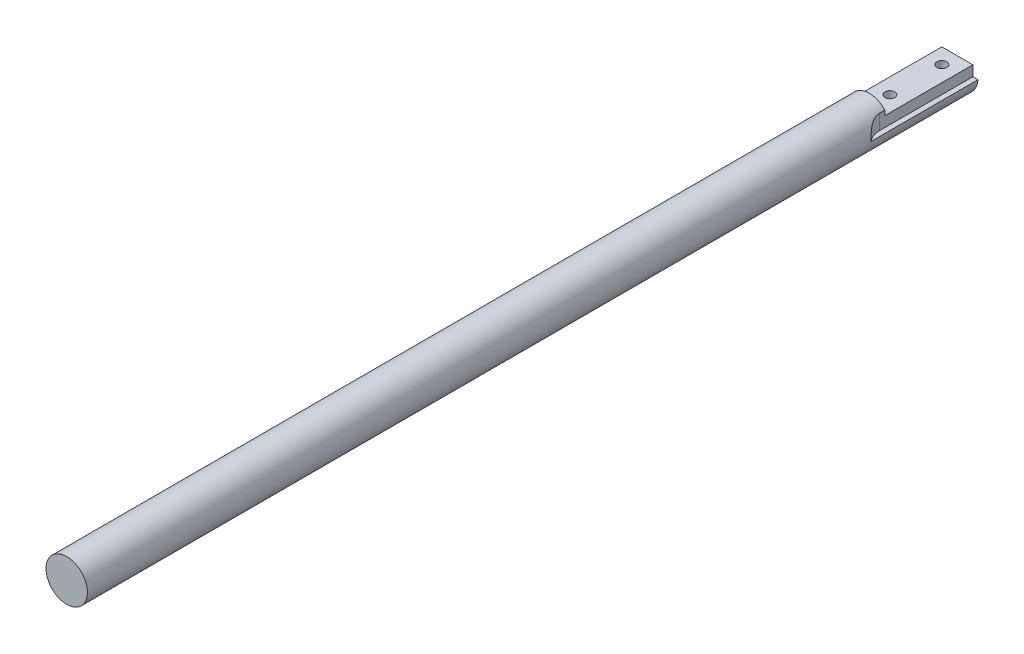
ISO-10303-21;
HEADER;
FILE_DESCRIPTION(('STEP AP214'),'2;1');
FILE_NAME('part.step','',(''),(''),'','','');
FILE_SCHEMA(('AUTOMOTIVE_DESIGN { 1 0 10303 214 1 1 1 1 }'));
ENDSEC;
DATA;
#1=APPLICATION_CONTEXT('core data for automotive mechanical design processes');
#2=APPLICATION_PROTOCOL_DEFINITION('international standard','automotive_design',2000,#1);
#3=PRODUCT_CONTEXT('',#1,'mechanical');
#4=PRODUCT('Part','Part','',(#3));
#5=PRODUCT_RELATED_PRODUCT_CATEGORY('part','',(#4));
#6=PRODUCT_DEFINITION_FORMATION('','',#4);
#7=PRODUCT_DEFINITION_CONTEXT('part definition',#1,'design');
#8=PRODUCT_DEFINITION('design','',#6,#7);
#9=PRODUCT_DEFINITION_SHAPE('','',#8);
#10=(LENGTH_UNIT() NAMED_UNIT(*) SI_UNIT(.MILLI.,.METRE.));
#11=(NAMED_UNIT(*) PLANE_ANGLE_UNIT() SI_UNIT($,.RADIAN.));
#12=(NAMED_UNIT(*) SI_UNIT($,.STERADIAN.) SOLID_ANGLE_UNIT());
#13=UNCERTAINTY_MEASURE_WITH_UNIT(LENGTH_MEASURE(1.E-05),#10,'distance_accuracy_value','');
#14=(GEOMETRIC_REPRESENTATION_CONTEXT(3) GLOBAL_UNCERTAINTY_ASSIGNED_CONTEXT((#13)) GLOBAL_UNIT_ASSIGNED_CONTEXT((#10,
#11,#12)) REPRESENTATION_CONTEXT('',''));
#15=CARTESIAN_POINT('',(0.,0.,0.));
#16=DIRECTION('',(0.,0.,1.));
#17=DIRECTION('',(1.,0.,0.));
#18=AXIS2_PLACEMENT_3D('',#15,#16,#17);
#19=CARTESIAN_POINT('',(0.,0.,136.525));
#20=DIRECTION('',(0.,0.,-1.));
#21=DIRECTION('',(-1.,0.,0.));
#22=AXIS2_PLACEMENT_3D('',#19,#20,#21);
#23=CYLINDRICAL_SURFACE('',#22,3.17500000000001);
#24=CARTESIAN_POINT('',(0.,-3.17500000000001,9.57580866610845));
#25=CARTESIAN_POINT('',(0.0421595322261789,-3.17499925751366,9.57601101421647));
#26=CARTESIAN_POINT('',(0.0843169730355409,-3.17415185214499,9.57972157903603));
#27=CARTESIAN_POINT('',(0.167393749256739,-3.17085734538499,9.59404425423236));
#28=CARTESIAN_POINT('',(0.20831230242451,-3.16840925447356,9.60466063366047));
#29=CARTESIAN_POINT('',(0.287700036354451,-3.16218880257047,9.632438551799));
#30=CARTESIAN_POINT('',(0.326171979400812,-3.15841796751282,9.64959255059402));
#31=CARTESIAN_POINT('',(0.399692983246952,-3.14995900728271,9.68993424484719));
#32=CARTESIAN_POINT('',(0.434741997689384,-3.14527086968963,9.7131220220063));
#33=CARTESIAN_POINT('',(0.501090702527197,-3.13539131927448,9.76534097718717));
#34=CARTESIAN_POINT('',(0.532315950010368,-3.13019266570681,9.79446537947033));
#35=CARTESIAN_POINT('',(0.589487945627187,-3.11993181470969,9.85752729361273));
#36=CARTESIAN_POINT('',(0.615434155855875,-3.11486963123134,9.89146529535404));
#37=CARTESIAN_POINT('',(0.661640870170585,-3.10538595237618,9.96374546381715));
#38=CARTESIAN_POINT('',(0.681821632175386,-3.10097381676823,10.0021399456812));
#39=CARTESIAN_POINT('',(0.715414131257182,-3.09339719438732,10.0818991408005));
#40=CARTESIAN_POINT('',(0.728826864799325,-3.09023252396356,10.1232634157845));
#41=CARTESIAN_POINT('',(0.748256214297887,-3.0855852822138,10.2069706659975));
#42=CARTESIAN_POINT('',(0.754406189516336,-3.08407242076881,10.2492809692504));
#43=CARTESIAN_POINT('',(0.75954839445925,-3.08281022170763,10.3343575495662));
#44=CARTESIAN_POINT('',(0.758541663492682,-3.08306062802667,10.377123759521));
#45=CARTESIAN_POINT('',(0.749508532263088,-3.08526853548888,10.4609159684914));
#46=CARTESIAN_POINT('',(0.741635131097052,-3.08718882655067,10.5019595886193));
#47=CARTESIAN_POINT('',(0.719331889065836,-3.0924612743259,10.5821266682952));
#48=CARTESIAN_POINT('',(0.704901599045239,-3.09581352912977,10.6212499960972));
#49=CARTESIAN_POINT('',(0.669747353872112,-3.10360904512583,10.6969080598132));
#50=CARTESIAN_POINT('',(0.648963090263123,-3.10806267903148,10.7334136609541));
#51=CARTESIAN_POINT('',(0.601734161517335,-3.11755025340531,10.8024762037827));
#52=CARTESIAN_POINT('',(0.575288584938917,-3.12258428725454,10.8350325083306));
#53=CARTESIAN_POINT('',(0.516675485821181,-3.13282256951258,10.8961551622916));
#54=CARTESIAN_POINT('',(0.484377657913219,-3.13802785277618,10.9245965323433));
#55=CARTESIAN_POINT('',(0.415405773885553,-3.14790006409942,10.9756802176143));
#56=CARTESIAN_POINT('',(0.378731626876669,-3.15256698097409,10.9983224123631));
#57=CARTESIAN_POINT('',(0.301906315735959,-3.16084984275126,11.0371897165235));
#58=CARTESIAN_POINT('',(0.261747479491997,-3.1644633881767,11.053400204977));
#59=CARTESIAN_POINT('',(0.179169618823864,-3.17021040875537,11.0788074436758));
#60=CARTESIAN_POINT('',(0.13675099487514,-3.17234414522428,11.0880054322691));
#61=CARTESIAN_POINT('',(0.0519409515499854,-3.17485180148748,11.0989438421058));
#62=CARTESIAN_POINT('',(0.00957292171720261,-3.17526640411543,11.1008565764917));
#63=CARTESIAN_POINT('',(-0.074874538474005,-3.17439781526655,11.0976380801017));
#64=CARTESIAN_POINT('',(-0.11695399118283,-3.17311475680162,11.0925074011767));
#65=CARTESIAN_POINT('',(-0.199073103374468,-3.16901636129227,11.0754880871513));
#66=CARTESIAN_POINT('',(-0.239132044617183,-3.16622095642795,11.0636872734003));
#67=CARTESIAN_POINT('',(-0.316700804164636,-3.1594054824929,11.0337611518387));
#68=CARTESIAN_POINT('',(-0.354210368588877,-3.15538529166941,11.0156352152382));
#69=CARTESIAN_POINT('',(-0.426327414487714,-3.14646056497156,10.9732167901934));
#70=CARTESIAN_POINT('',(-0.460873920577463,-3.14154201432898,10.9488236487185));
#71=CARTESIAN_POINT('',(-0.52544420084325,-3.13139004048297,10.8946964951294));
#72=CARTESIAN_POINT('',(-0.555467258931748,-3.12615656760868,10.8649616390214));
#73=CARTESIAN_POINT('',(-0.6108256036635,-3.1158191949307,10.8002033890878));
#74=CARTESIAN_POINT('',(-0.63604152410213,-3.11072078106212,10.7650769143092));
#75=CARTESIAN_POINT('',(-0.680216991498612,-3.10136127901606,10.690984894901));
#76=CARTESIAN_POINT('',(-0.699176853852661,-3.0971001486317,10.6520195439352));
#77=CARTESIAN_POINT('',(-0.730150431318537,-3.08994466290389,10.571599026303));
#78=CARTESIAN_POINT('',(-0.742209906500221,-3.08704132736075,10.5301623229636));
#79=CARTESIAN_POINT('',(-0.759172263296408,-3.08291423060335,10.4457704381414));
#80=CARTESIAN_POINT('',(-0.764076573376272,-3.08169013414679,10.4028155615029));
#81=CARTESIAN_POINT('',(-0.766526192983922,-3.08108157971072,10.3178335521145));
#82=CARTESIAN_POINT('',(-0.764264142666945,-3.08164896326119,10.2758122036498));
#83=CARTESIAN_POINT('',(-0.752878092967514,-3.0844502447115,10.1927691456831));
#84=CARTESIAN_POINT('',(-0.743754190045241,-3.08668411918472,10.1517474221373));
#85=CARTESIAN_POINT('',(-0.718999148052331,-3.09254339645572,10.072034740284));
#86=CARTESIAN_POINT('',(-0.703397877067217,-3.09616240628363,10.0333340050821));
#87=CARTESIAN_POINT('',(-0.666155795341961,-3.10438779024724,9.95907159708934));
#88=CARTESIAN_POINT('',(-0.644514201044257,-3.10899429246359,9.92351033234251));
#89=CARTESIAN_POINT('',(-0.595180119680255,-3.1188189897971,9.85559473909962));
#90=CARTESIAN_POINT('',(-0.56735205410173,-3.12404943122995,9.82334064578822));
#91=CARTESIAN_POINT('',(-0.50670845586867,-3.13445630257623,9.7638980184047));
#92=CARTESIAN_POINT('',(-0.473891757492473,-3.13963271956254,9.73671067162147));
#93=CARTESIAN_POINT('',(-0.403561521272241,-3.14945115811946,9.68774801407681));
#94=CARTESIAN_POINT('',(-0.365980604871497,-3.15408318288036,9.66606734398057));
#95=CARTESIAN_POINT('',(-0.287600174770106,-3.16219199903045,9.62936737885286));
#96=CARTESIAN_POINT('',(-0.246803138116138,-3.16566966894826,9.61434301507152));
#97=CARTESIAN_POINT('',(-0.171689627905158,-3.17053067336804,9.59376001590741));
#98=CARTESIAN_POINT('',(-0.137742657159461,-3.1721961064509,9.58689769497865));
#99=CARTESIAN_POINT('',(-0.0691966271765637,-3.17443103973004,9.57783914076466));
#100=CARTESIAN_POINT('',(-0.0345976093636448,-3.17500060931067,9.57564261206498));
#101=CARTESIAN_POINT('',(0.,-3.17500000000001,9.57580866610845));
#102=B_SPLINE_CURVE_WITH_KNOTS('',3,(#24,#25,#26,#27,#28,#29,#30,#31,#32,#33,#34,#35,#36,#37,
#38,#39,#40,#41,#42,#43,#44,#45,#46,#47,#48,#49,#50,#51,#52,#53,#54,#55,#56,#57,#58,#59,#60,#61,
#62,#63,#64,#65,#66,#67,#68,#69,#70,#71,#72,#73,#74,#75,#76,#77,#78,#79,#80,#81,#82,#83,#84,#85,
#86,#87,#88,#89,#90,#91,#92,#93,#94,#95,#96,#97,#98,#99,#100,#101),.UNSPECIFIED.,.T.,.F.,(4,2,2,
2,2,2,2,2,2,2,2,2,2,2,2,2,2,2,2,2,2,2,2,2,2,2,2,2,2,2,2,2,2,2,2,2,2,2,4),(0.,0.126353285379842,
0.252784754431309,0.379070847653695,0.505358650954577,0.633808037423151,0.762270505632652,
0.892432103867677,1.02257453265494,1.15028816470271,1.2779832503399,1.40290376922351,
1.52783284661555,1.65398657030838,1.78016061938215,1.90959813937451,2.03903834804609,
2.16877114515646,2.29848102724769,2.42510320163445,2.55171545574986,2.67669827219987,
2.80169351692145,2.92883756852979,3.0560017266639,3.18599950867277,3.3159907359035,
3.44510962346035,3.57420273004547,3.69985539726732,3.8255062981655,3.95058412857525,
4.07567819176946,4.2038451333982,4.33204207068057,4.4623123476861,4.5924832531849,
4.69617981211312,4.79986980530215),.UNSPECIFIED.);
#103=CARTESIAN_POINT('',(0.,-3.17500000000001,9.57580866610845));
#104=VERTEX_POINT('',#103);
#105=EDGE_CURVE('E11',#104,#104,#102,.T.);
#106=ORIENTED_EDGE('',*,*,#105,.F.);
#107=EDGE_LOOP('',(#106));
#108=FACE_BOUND('',#107,.T.);
#109=CARTESIAN_POINT('',(0.,-3.17500000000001,1.60036599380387));
#110=CARTESIAN_POINT('',(0.0421684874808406,-3.17499926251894,1.60124759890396));
#111=CARTESIAN_POINT('',(0.084278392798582,-3.17415150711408,1.60563987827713));
#112=CARTESIAN_POINT('',(0.167148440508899,-3.1708689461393,1.62131106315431));
#113=CARTESIAN_POINT('',(0.207907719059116,-3.16843314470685,1.63259428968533));
#114=CARTESIAN_POINT('',(0.286870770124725,-3.16226146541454,1.6616721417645));
#115=CARTESIAN_POINT('',(0.325077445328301,-3.158527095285,1.6794592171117));
#116=CARTESIAN_POINT('',(0.397969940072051,-3.15017344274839,1.72101917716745));
#117=CARTESIAN_POINT('',(0.432655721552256,-3.14555415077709,1.74479212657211));
#118=CARTESIAN_POINT('',(0.498179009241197,-3.13585071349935,1.79812816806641));
#119=CARTESIAN_POINT('',(0.52894081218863,-3.13075998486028,1.82778307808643));
#120=CARTESIAN_POINT('',(0.585101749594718,-3.12075256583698,1.89182784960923));
#121=CARTESIAN_POINT('',(0.610500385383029,-3.11583589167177,1.92621815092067));
#122=CARTESIAN_POINT('',(0.655504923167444,-3.10668214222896,1.99927304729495));
#123=CARTESIAN_POINT('',(0.675037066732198,-3.10245400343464,2.03798429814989));
#124=CARTESIAN_POINT('',(0.707287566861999,-3.0952615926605,2.11825801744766));
#125=CARTESIAN_POINT('',(0.720006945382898,-3.0922971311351,2.15982005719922));
#126=CARTESIAN_POINT('',(0.738037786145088,-3.08804311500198,2.24377831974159));
#127=CARTESIAN_POINT('',(0.74348519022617,-3.08672285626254,2.28614376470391));
#128=CARTESIAN_POINT('',(0.747230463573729,-3.08581850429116,2.37120513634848));
#129=CARTESIAN_POINT('',(0.745529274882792,-3.08623418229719,2.41390101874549));
#130=CARTESIAN_POINT('',(0.735145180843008,-3.08872356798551,2.4975061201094));
#131=CARTESIAN_POINT('',(0.726603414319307,-3.09076375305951,2.53843400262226));
#132=CARTESIAN_POINT('',(0.702989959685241,-3.09621958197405,2.6182624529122));
#133=CARTESIAN_POINT('',(0.687917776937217,-3.09963533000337,2.65716286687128));
#134=CARTESIAN_POINT('',(0.651490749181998,-3.10749643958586,2.7323234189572));
#135=CARTESIAN_POINT('',(0.630068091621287,-3.11195279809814,2.76854949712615));
#136=CARTESIAN_POINT('',(0.581601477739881,-3.12137350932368,2.83695095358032));
#137=CARTESIAN_POINT('',(0.554556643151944,-3.12633794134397,2.86912569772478));
#138=CARTESIAN_POINT('',(0.494819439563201,-3.13635399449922,2.9293398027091));
#139=CARTESIAN_POINT('',(0.462004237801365,-3.14140474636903,2.95725760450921));
#140=CARTESIAN_POINT('',(0.392083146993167,-3.15089489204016,3.00720863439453));
#141=CARTESIAN_POINT('',(0.354977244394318,-3.15533428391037,3.02924184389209));
#142=CARTESIAN_POINT('',(0.277483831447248,-3.1630905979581,3.06677099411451));
#143=CARTESIAN_POINT('',(0.237096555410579,-3.1664076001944,3.08226740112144));
#144=CARTESIAN_POINT('',(0.154195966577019,-3.17152504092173,3.10622324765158));
#145=CARTESIAN_POINT('',(0.111683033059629,-3.17332574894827,3.11468393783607));
#146=CARTESIAN_POINT('',(0.0268357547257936,-3.17516333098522,3.12416832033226));
#147=CARTESIAN_POINT('',(-0.0154783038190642,-3.17524157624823,3.12536594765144));
#148=CARTESIAN_POINT('',(-0.0996892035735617,-3.17371396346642,3.1207525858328));
#149=CARTESIAN_POINT('',(-0.141586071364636,-3.17210821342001,3.11494204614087));
#150=CARTESIAN_POINT('',(-0.223320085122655,-3.1673983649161,3.09661033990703));
#151=CARTESIAN_POINT('',(-0.263174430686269,-3.16431042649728,3.08416139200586));
#152=CARTESIAN_POINT('',(-0.340229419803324,-3.15695556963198,3.05298589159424));
#153=CARTESIAN_POINT('',(-0.377429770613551,-3.15268852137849,3.03425864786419));
#154=CARTESIAN_POINT('',(-0.448897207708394,-3.14331689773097,2.99064786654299));
#155=CARTESIAN_POINT('',(-0.483095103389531,-3.13819794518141,2.96565408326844));
#156=CARTESIAN_POINT('',(-0.546871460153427,-3.12771530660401,2.9103781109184));
#157=CARTESIAN_POINT('',(-0.576449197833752,-3.12235158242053,2.88009509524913));
#158=CARTESIAN_POINT('',(-0.630794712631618,-3.11183341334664,2.81431968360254));
#159=CARTESIAN_POINT('',(-0.655445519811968,-3.10668593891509,2.77872935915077));
#160=CARTESIAN_POINT('',(-0.698413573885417,-3.09730999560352,2.70379894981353));
#161=CARTESIAN_POINT('',(-0.716731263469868,-3.09308146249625,2.66445912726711));
#162=CARTESIAN_POINT('',(-0.746322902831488,-3.0860748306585,2.58349825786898));
#163=CARTESIAN_POINT('',(-0.757659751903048,-3.08328381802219,2.54190137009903));
#164=CARTESIAN_POINT('',(-0.773165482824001,-3.07943263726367,2.4573170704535));
#165=CARTESIAN_POINT('',(-0.777335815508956,-3.07837211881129,2.41432994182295));
#166=CARTESIAN_POINT('',(-0.778350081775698,-3.07811563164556,2.32944505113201));
#167=CARTESIAN_POINT('',(-0.775391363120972,-3.07886943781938,2.28754966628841));
#168=CARTESIAN_POINT('',(-0.762658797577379,-3.08204784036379,2.20487531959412));
#169=CARTESIAN_POINT('',(-0.752884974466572,-3.08447243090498,2.16409635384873));
#170=CARTESIAN_POINT('',(-0.72687680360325,-3.09070409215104,2.08490102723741));
#171=CARTESIAN_POINT('',(-0.710660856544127,-3.09450722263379,2.04647829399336));
#172=CARTESIAN_POINT('',(-0.672248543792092,-3.10307791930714,1.9728666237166));
#173=CARTESIAN_POINT('',(-0.650051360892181,-3.1078456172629,1.93767812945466));
#174=CARTESIAN_POINT('',(-0.599628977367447,-3.11797154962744,1.87055288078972));
#175=CARTESIAN_POINT('',(-0.571262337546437,-3.12334189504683,1.83872416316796));
#176=CARTESIAN_POINT('',(-0.509611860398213,-3.1339906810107,1.78021783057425));
#177=CARTESIAN_POINT('',(-0.47632688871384,-3.13926910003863,1.75354140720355));
#178=CARTESIAN_POINT('',(-0.405156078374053,-3.14925123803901,1.70569854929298));
#179=CARTESIAN_POINT('',(-0.367206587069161,-3.15394471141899,1.68462452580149));
#180=CARTESIAN_POINT('',(-0.2881914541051,-3.16214216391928,1.64919565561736));
#181=CARTESIAN_POINT('',(-0.247128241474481,-3.16564705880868,1.6348356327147));
#182=CARTESIAN_POINT('',(-0.17170892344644,-3.17053067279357,1.61550088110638));
#183=CARTESIAN_POINT('',(-0.137703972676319,-3.17219799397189,1.60920549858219));
#184=CARTESIAN_POINT('',(-0.0691195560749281,-3.17443292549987,1.60127713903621));
#185=CARTESIAN_POINT('',(-0.0345401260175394,-3.17500060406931,1.59964387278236));
#186=CARTESIAN_POINT('',(0.,-3.17500000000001,1.60036599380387));
#187=B_SPLINE_CURVE_WITH_KNOTS('',3,(#109,#110,#111,#112,#113,#114,#115,#116,#117,#118,#119,
#120,#121,#122,#123,#124,#125,#126,#127,#128,#129,#130,#131,#132,#133,#134,#135,#136,#137,#138,
#139,#140,#141,#142,#143,#144,#145,#146,#147,#148,#149,#150,#151,#152,#153,#154,#155,#156,#157,
#158,#159,#160,#161,#162,#163,#164,#165,#166,#167,#168,#169,#170,#171,#172,#173,#174,#175,#176,
#177,#178,#179,#180,#181,#182,#183,#184,#185,#186),.UNSPECIFIED.,.T.,.F.,(4,2,2,2,2,2,2,2,2,2,2,
2,2,2,2,2,2,2,2,2,2,2,2,2,2,2,2,2,2,2,2,2,2,2,2,2,2,2,4),(0.,0.126406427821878,
0.252892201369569,0.379231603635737,0.505572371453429,0.634067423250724,0.762574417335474,
0.892635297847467,1.022676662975,1.15025131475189,1.27780915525,1.40280092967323,
1.52780217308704,1.65418950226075,1.78059658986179,1.91012119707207,2.0396462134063,
2.1691619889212,2.29865473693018,2.42503375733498,2.55140467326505,2.67642804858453,
2.80146519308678,2.92887888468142,3.05631250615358,3.18648350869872,3.31664541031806,
3.44561666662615,3.57456181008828,3.6999786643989,3.82539508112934,3.9504558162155,
4.07553364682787,4.20385621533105,4.33220842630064,4.46256218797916,4.59281528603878,
4.69636096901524,4.79990022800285),.UNSPECIFIED.);
#188=CARTESIAN_POINT('',(0.,-3.17500000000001,1.60036599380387));
#189=VERTEX_POINT('',#188);
#190=EDGE_CURVE('E46',#189,#189,#187,.T.);
#191=ORIENTED_EDGE('',*,*,#190,.F.);
#192=EDGE_LOOP('',(#191));
#193=FACE_BOUND('',#192,.T.);
#194=CARTESIAN_POINT('',(0.,0.,136.525));
#195=DIRECTION('',(0.,0.,-1.));
#196=DIRECTION('',(-1.,0.,0.));
#197=AXIS2_PLACEMENT_3D('',#194,#195,#196);
#198=CIRCLE('',#197,3.17500000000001);
#199=CARTESIAN_POINT('',(-3.17500000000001,0.,136.525));
#200=VERTEX_POINT('',#199);
#201=EDGE_CURVE('E161',#200,#200,#198,.T.);
#202=ORIENTED_EDGE('',*,*,#201,.T.);
#203=EDGE_LOOP('',(#202));
#204=FACE_BOUND('',#203,.T.);
#205=CARTESIAN_POINT('',(0.,0.,13.49375));
#206=DIRECTION('',(0.,0.,-1.));
#207=DIRECTION('',(-1.,0.,0.));
#208=AXIS2_PLACEMENT_3D('',#205,#206,#207);
#209=CIRCLE('',#208,3.17500000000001);
#210=CARTESIAN_POINT('',(2.38125,2.10006510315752,13.49375));
#211=VERTEX_POINT('',#210);
#212=CARTESIAN_POINT('',(-2.38125,2.10006510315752,13.49375));
#213=VERTEX_POINT('',#212);
#214=EDGE_CURVE('E166',#211,#213,#209,.F.);
#215=ORIENTED_EDGE('',*,*,#214,.T.);
#216=DIRECTION('',(0.,0.,-1.));
#217=VECTOR('',#216,1.);
#218=CARTESIAN_POINT('',(-2.38125,2.10006510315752,136.525));
#219=LINE('',#218,#217);
#220=CARTESIAN_POINT('',(-2.38125,2.10006510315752,14.2875));
#221=VERTEX_POINT('',#220);
#222=EDGE_CURVE('E127',#213,#221,#219,.F.);
#223=ORIENTED_EDGE('',*,*,#222,.T.);
#224=CARTESIAN_POINT('',(-3.17500000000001,0.,16.3875651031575));
#225=CARTESIAN_POINT('',(-3.17499373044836,-0.114105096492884,16.3875662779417));
#226=CARTESIAN_POINT('',(-3.16880431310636,-0.228314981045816,16.3806040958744));
#227=CARTESIAN_POINT('',(-3.14445190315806,-0.453811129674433,16.3524915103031));
#228=CARTESIAN_POINT('',(-3.12627048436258,-0.565092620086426,16.3313192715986));
#229=CARTESIAN_POINT('',(-3.07928517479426,-0.781599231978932,16.2741146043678));
#230=CARTESIAN_POINT('',(-3.05046985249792,-0.886817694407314,16.2380661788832));
#231=CARTESIAN_POINT('',(-2.98470907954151,-1.08780005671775,16.1505031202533));
#232=CARTESIAN_POINT('',(-2.94776944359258,-1.18357064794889,16.0989995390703));
#233=CARTESIAN_POINT('',(-2.87006273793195,-1.36109667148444,15.9815668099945));
#234=CARTESIAN_POINT('',(-2.82938319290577,-1.44308671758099,15.9159349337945));
#235=CARTESIAN_POINT('',(-2.74766913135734,-1.59319182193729,15.7705468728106));
#236=CARTESIAN_POINT('',(-2.7066346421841,-1.66130793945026,15.6907917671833));
#237=CARTESIAN_POINT('',(-2.62962545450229,-1.78061484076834,15.5219274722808));
#238=CARTESIAN_POINT('',(-2.59352800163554,-1.83229246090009,15.4332167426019));
#239=CARTESIAN_POINT('',(-2.52801303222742,-1.9216810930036,15.2467560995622));
#240=CARTESIAN_POINT('',(-2.49859687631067,-1.95938926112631,15.1490043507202));
#241=CARTESIAN_POINT('',(-2.44817130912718,-2.02206600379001,14.9446324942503));
#242=CARTESIAN_POINT('',(-2.42738954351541,-2.04669386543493,14.8378521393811));
#243=CARTESIAN_POINT('',(-2.3968532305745,-2.08237160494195,14.6205056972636));
#244=CARTESIAN_POINT('',(-2.38710192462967,-2.09341749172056,14.5099385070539));
#245=CARTESIAN_POINT('',(-2.37912529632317,-2.10248275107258,14.2826577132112));
#246=CARTESIAN_POINT('',(-2.3814602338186,-2.09986887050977,14.1658984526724));
#247=CARTESIAN_POINT('',(-2.39879593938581,-2.08004152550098,13.9345616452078));
#248=CARTESIAN_POINT('',(-2.41379819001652,-2.0628263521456,13.8199843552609));
#249=CARTESIAN_POINT('',(-2.4555228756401,-2.01298183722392,13.595180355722));
#250=CARTESIAN_POINT('',(-2.48236070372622,-1.98020048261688,13.4850084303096));
#251=CARTESIAN_POINT('',(-2.54542460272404,-1.89844295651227,13.2737462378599));
#252=CARTESIAN_POINT('',(-2.58164651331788,-1.84947395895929,13.1726519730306));
#253=CARTESIAN_POINT('',(-2.6583726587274,-1.73726664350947,12.9864665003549));
#254=CARTESIAN_POINT('',(-2.69865613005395,-1.67465589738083,12.9009064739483));
#255=CARTESIAN_POINT('',(-2.78055309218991,-1.53482479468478,12.7434732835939));
#256=CARTESIAN_POINT('',(-2.82216623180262,-1.4576082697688,12.6715965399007));
#257=CARTESIAN_POINT('',(-2.90092371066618,-1.29352877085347,12.5453138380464));
#258=CARTESIAN_POINT('',(-2.93817863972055,-1.20715439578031,12.4903396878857));
#259=CARTESIAN_POINT('',(-3.0066570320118,-1.02475707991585,12.394437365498));
#260=CARTESIAN_POINT('',(-3.03787928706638,-0.928732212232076,12.3535120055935));
#261=CARTESIAN_POINT('',(-3.09222873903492,-0.727854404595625,12.2847036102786));
#262=CARTESIAN_POINT('',(-3.11519555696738,-0.622871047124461,12.2570757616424));
#263=CARTESIAN_POINT('',(-3.15048522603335,-0.408508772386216,12.2153831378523));
#264=CARTESIAN_POINT('',(-3.16280500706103,-0.299128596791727,12.2013222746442));
#265=CARTESIAN_POINT('',(-3.17625369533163,-0.0735132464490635,12.1859863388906));
#266=CARTESIAN_POINT('',(-3.17681986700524,0.0427997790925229,12.1853541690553));
#267=CARTESIAN_POINT('',(-3.16527304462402,0.273992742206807,12.1984984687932));
#268=CARTESIAN_POINT('',(-3.15315796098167,0.388872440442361,12.2122773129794));
#269=CARTESIAN_POINT('',(-3.11686760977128,0.615757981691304,12.2550540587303));
#270=CARTESIAN_POINT('',(-3.09250434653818,0.727689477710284,12.2842895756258));
#271=CARTESIAN_POINT('',(-3.03371189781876,0.943230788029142,12.3588566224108));
#272=CARTESIAN_POINT('',(-2.99928667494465,1.04684385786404,12.4041818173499));
#273=CARTESIAN_POINT('',(-2.92500990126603,1.23903067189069,12.5095271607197));
#274=CARTESIAN_POINT('',(-2.88538722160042,1.32800064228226,12.568984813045));
#275=CARTESIAN_POINT('',(-2.80381970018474,1.49253558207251,12.7029269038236));
#276=CARTESIAN_POINT('',(-2.76187562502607,1.56810494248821,12.777406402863));
#277=CARTESIAN_POINT('',(-2.68174153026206,1.70138147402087,12.9364254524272));
#278=CARTESIAN_POINT('',(-2.64346772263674,1.7597114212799,13.0204027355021));
#279=CARTESIAN_POINT('',(-2.57226612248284,1.86225219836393,13.1986157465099));
#280=CARTESIAN_POINT('',(-2.53933925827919,1.90646057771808,13.2928532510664));
#281=CARTESIAN_POINT('',(-2.48127453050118,1.98146146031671,13.490102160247));
#282=CARTESIAN_POINT('',(-2.45623176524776,2.01209185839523,13.5932029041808));
#283=CARTESIAN_POINT('',(-2.41637708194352,2.05978523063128,13.8044023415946));
#284=CARTESIAN_POINT('',(-2.40156806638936,2.0768443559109,13.9125024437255));
#285=CARTESIAN_POINT('',(-2.38278169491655,2.09838001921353,14.1361501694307));
#286=CARTESIAN_POINT('',(-2.37935718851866,2.10221466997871,14.2518064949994));
#287=CARTESIAN_POINT('',(-2.38513933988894,2.09565060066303,14.482416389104));
#288=CARTESIAN_POINT('',(-2.39434855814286,2.08524899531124,14.5973698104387));
#289=CARTESIAN_POINT('',(-2.42505594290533,2.04946266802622,14.8258368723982));
#290=CARTESIAN_POINT('',(-2.44681346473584,2.02376135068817,14.9392667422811));
#291=CARTESIAN_POINT('',(-2.50099572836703,1.95639997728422,15.1585882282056));
#292=CARTESIAN_POINT('',(-2.53341704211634,1.91474504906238,15.2644822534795));
#293=CARTESIAN_POINT('',(-2.60479004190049,1.81638515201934,15.46233877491));
#294=CARTESIAN_POINT('',(-2.64351868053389,1.76016494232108,15.5546220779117));
#295=CARTESIAN_POINT('',(-2.72429416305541,1.63233933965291,15.7261254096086));
#296=CARTESIAN_POINT('',(-2.76633946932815,1.5607410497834,15.8053514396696));
#297=CARTESIAN_POINT('',(-2.84747574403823,1.40701841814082,15.9456487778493));
#298=CARTESIAN_POINT('',(-2.88661408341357,1.32552137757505,16.0073821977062));
#299=CARTESIAN_POINT('',(-2.96028509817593,1.15162818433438,16.1166948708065));
#300=CARTESIAN_POINT('',(-2.99481550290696,1.05922670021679,16.1642671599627));
#301=CARTESIAN_POINT('',(-3.0564100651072,0.865654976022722,16.245573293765));
#302=CARTESIAN_POINT('',(-3.08343555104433,0.764442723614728,16.2792358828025));
#303=CARTESIAN_POINT('',(-3.12764732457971,0.556522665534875,16.3329178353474));
#304=CARTESIAN_POINT('',(-3.14484569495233,0.44982178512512,16.3529539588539));
#305=CARTESIAN_POINT('',(-3.16266595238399,0.285331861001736,16.3735138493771));
#306=CARTESIAN_POINT('',(-3.16728172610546,0.228499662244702,16.3787862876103));
#307=CARTESIAN_POINT('',(-3.17345032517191,0.114453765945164,16.3858116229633));
#308=CARTESIAN_POINT('',(-3.17500314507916,0.0572400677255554,16.3875645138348));
#309=CARTESIAN_POINT('',(-3.17500000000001,0.,16.3875651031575));
#310=B_SPLINE_CURVE_WITH_KNOTS('',3,(#224,#225,#226,#227,#228,#229,#230,#231,#232,#233,#234,
#235,#236,#237,#238,#239,#240,#241,#242,#243,#244,#245,#246,#247,#248,#249,#250,#251,#252,#253,
#254,#255,#256,#257,#258,#259,#260,#261,#262,#263,#264,#265,#266,#267,#268,#269,#270,#271,#272,
#273,#274,#275,#276,#277,#278,#279,#280,#281,#282,#283,#284,#285,#286,#287,#288,#289,#290,#291,
#292,#293,#294,#295,#296,#297,#298,#299,#300,#301,#302,#303,#304,#305,#306,#307,#308,#309),
.UNSPECIFIED.,.T.,.F.,(4,2,2,2,2,2,2,2,2,2,2,2,2,2,2,2,2,2,2,2,2,2,2,2,2,2,2,2,2,2,2,2,2,2,2,2,
2,2,2,2,2,2,4),(0.,0.342115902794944,0.684758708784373,1.02777093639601,1.37053845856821,
1.70669738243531,2.04283063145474,2.36780437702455,2.69284424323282,3.02598021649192,
3.35921405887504,3.70802947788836,4.05688572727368,4.40922111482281,4.76140056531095,
5.09991151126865,5.43833377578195,5.76366700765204,6.08906532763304,6.42048121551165,
6.75199263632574,7.09934127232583,7.44674715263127,7.79965600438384,8.15242606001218,
8.49299444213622,8.83345102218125,9.15943432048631,9.48547415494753,9.81530806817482,
10.1452354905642,10.4909673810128,10.8367693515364,11.1899886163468,11.5430944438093,
11.8856922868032,12.2281322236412,12.5549883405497,12.8820049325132,13.2106765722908,
13.5389432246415,13.710563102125,13.8821832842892),.UNSPECIFIED.);
#311=CARTESIAN_POINT('',(-3.16879276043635,-0.198437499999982,16.3805057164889));
#312=VERTEX_POINT('',#311);
#313=EDGE_CURVE('E123',#221,#312,#310,.T.);
#314=ORIENTED_EDGE('',*,*,#313,.T.);
#315=DIRECTION('',(0.,0.,-1.));
#316=VECTOR('',#315,1.);
#317=CARTESIAN_POINT('',(-3.16879276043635,-0.198437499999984,136.525));
#318=LINE('',#317,#316);
#319=CARTESIAN_POINT('',(-3.16879276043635,-0.198437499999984,0.));
#320=VERTEX_POINT('',#319);
#321=EDGE_CURVE('E117',#320,#312,#318,.F.);
#322=ORIENTED_EDGE('',*,*,#321,.F.);
#323=CARTESIAN_POINT('',(0.,0.,0.));
#324=DIRECTION('',(0.,0.,-1.));
#325=DIRECTION('',(-1.,0.,0.));
#326=AXIS2_PLACEMENT_3D('',#323,#324,#325);
#327=CIRCLE('',#326,3.17500000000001);
#328=CARTESIAN_POINT('',(3.16879276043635,-0.198437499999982,0.));
#329=VERTEX_POINT('',#328);
#330=EDGE_CURVE('E158',#329,#320,#327,.T.);
#331=ORIENTED_EDGE('',*,*,#330,.F.);
#332=DIRECTION('',(0.,0.,-1.));
#333=VECTOR('',#332,1.);
#334=CARTESIAN_POINT('',(3.16879276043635,-0.198437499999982,136.525));
#335=LINE('',#334,#333);
#336=CARTESIAN_POINT('',(3.16879276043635,-0.198437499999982,16.3805057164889));
#337=VERTEX_POINT('',#336);
#338=EDGE_CURVE('E61',#337,#329,#335,.T.);
#339=ORIENTED_EDGE('',*,*,#338,.F.);
#340=CARTESIAN_POINT('',(3.17500000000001,0.,16.3875651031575));
#341=CARTESIAN_POINT('',(3.17499373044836,0.114105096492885,16.3875662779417));
#342=CARTESIAN_POINT('',(3.16880431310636,0.228314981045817,16.3806040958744));
#343=CARTESIAN_POINT('',(3.14445190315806,0.453811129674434,16.3524915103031));
#344=CARTESIAN_POINT('',(3.12627048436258,0.565092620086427,16.3313192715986));
#345=CARTESIAN_POINT('',(3.07928517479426,0.781599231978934,16.2741146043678));
#346=CARTESIAN_POINT('',(3.05046985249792,0.886817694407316,16.2380661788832));
#347=CARTESIAN_POINT('',(2.98470907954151,1.08780005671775,16.1505031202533));
#348=CARTESIAN_POINT('',(2.94776944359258,1.18357064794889,16.0989995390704));
#349=CARTESIAN_POINT('',(2.87006273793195,1.36109667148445,15.9815668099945));
#350=CARTESIAN_POINT('',(2.82938319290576,1.44308671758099,15.9159349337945));
#351=CARTESIAN_POINT('',(2.74766913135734,1.59319182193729,15.7705468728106));
#352=CARTESIAN_POINT('',(2.7066346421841,1.66130793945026,15.6907917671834));
#353=CARTESIAN_POINT('',(2.62962545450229,1.78061484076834,15.5219274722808));
#354=CARTESIAN_POINT('',(2.59352800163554,1.83229246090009,15.433216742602));
#355=CARTESIAN_POINT('',(2.52801303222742,1.92168109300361,15.2467560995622));
#356=CARTESIAN_POINT('',(2.49859687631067,1.95938926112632,15.1490043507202));
#357=CARTESIAN_POINT('',(2.44817130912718,2.02206600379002,14.9446324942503));
#358=CARTESIAN_POINT('',(2.42738954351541,2.04669386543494,14.8378521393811));
#359=CARTESIAN_POINT('',(2.3968532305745,2.08237160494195,14.6205056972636));
#360=CARTESIAN_POINT('',(2.38710192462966,2.09341749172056,14.5099385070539));
#361=CARTESIAN_POINT('',(2.37912529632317,2.10248275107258,14.2826577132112));
#362=CARTESIAN_POINT('',(2.38146023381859,2.09986887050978,14.1658984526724));
#363=CARTESIAN_POINT('',(2.3987959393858,2.08004152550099,13.9345616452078));
#364=CARTESIAN_POINT('',(2.41379819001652,2.06282635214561,13.819984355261));
#365=CARTESIAN_POINT('',(2.4555228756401,2.01298183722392,13.595180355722));
#366=CARTESIAN_POINT('',(2.48236070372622,1.98020048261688,13.4850084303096));
#367=CARTESIAN_POINT('',(2.54542460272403,1.89844295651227,13.2737462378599));
#368=CARTESIAN_POINT('',(2.58164651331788,1.8494739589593,13.1726519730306));
#369=CARTESIAN_POINT('',(2.65837265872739,1.73726664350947,12.9864665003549));
#370=CARTESIAN_POINT('',(2.69865613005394,1.67465589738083,12.9009064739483));
#371=CARTESIAN_POINT('',(2.78055309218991,1.53482479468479,12.7434732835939));
#372=CARTESIAN_POINT('',(2.82216623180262,1.45760826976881,12.6715965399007));
#373=CARTESIAN_POINT('',(2.90092371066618,1.29352877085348,12.5453138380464));
#374=CARTESIAN_POINT('',(2.93817863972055,1.20715439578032,12.4903396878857));
#375=CARTESIAN_POINT('',(3.0066570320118,1.02475707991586,12.394437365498));
#376=CARTESIAN_POINT('',(3.03787928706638,0.928732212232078,12.3535120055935));
#377=CARTESIAN_POINT('',(3.09222873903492,0.727854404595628,12.2847036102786));
#378=CARTESIAN_POINT('',(3.11519555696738,0.622871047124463,12.2570757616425));
#379=CARTESIAN_POINT('',(3.15048522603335,0.408508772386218,12.2153831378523));
#380=CARTESIAN_POINT('',(3.16280500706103,0.29912859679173,12.2013222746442));
#381=CARTESIAN_POINT('',(3.17625369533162,0.0735132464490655,12.1859863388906));
#382=CARTESIAN_POINT('',(3.17681986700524,-0.0427997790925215,12.1853541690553));
#383=CARTESIAN_POINT('',(3.16527304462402,-0.273992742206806,12.1984984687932));
#384=CARTESIAN_POINT('',(3.15315796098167,-0.38887244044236,12.2122773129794));
#385=CARTESIAN_POINT('',(3.11686760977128,-0.615757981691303,12.2550540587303));
#386=CARTESIAN_POINT('',(3.09250434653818,-0.727689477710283,12.2842895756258));
#387=CARTESIAN_POINT('',(3.03371189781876,-0.943230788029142,12.3588566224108));
#388=CARTESIAN_POINT('',(2.99928667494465,-1.04684385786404,12.4041818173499));
#389=CARTESIAN_POINT('',(2.92500990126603,-1.23903067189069,12.5095271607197));
#390=CARTESIAN_POINT('',(2.88538722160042,-1.32800064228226,12.568984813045));
#391=CARTESIAN_POINT('',(2.80381970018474,-1.49253558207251,12.7029269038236));
#392=CARTESIAN_POINT('',(2.76187562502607,-1.56810494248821,12.777406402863));
#393=CARTESIAN_POINT('',(2.68174153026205,-1.70138147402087,12.9364254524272));
#394=CARTESIAN_POINT('',(2.64346772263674,-1.75971142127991,13.0204027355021));
#395=CARTESIAN_POINT('',(2.57226612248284,-1.86225219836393,13.1986157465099));
#396=CARTESIAN_POINT('',(2.53933925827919,-1.90646057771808,13.2928532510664));
#397=CARTESIAN_POINT('',(2.48127453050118,-1.98146146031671,13.490102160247));
#398=CARTESIAN_POINT('',(2.45623176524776,-2.01209185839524,13.5932029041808));
#399=CARTESIAN_POINT('',(2.41637708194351,-2.05978523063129,13.8044023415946));
#400=CARTESIAN_POINT('',(2.40156806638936,-2.07684435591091,13.9125024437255));
#401=CARTESIAN_POINT('',(2.38278169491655,-2.09838001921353,14.1361501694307));
#402=CARTESIAN_POINT('',(2.37935718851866,-2.10221466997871,14.2518064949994));
#403=CARTESIAN_POINT('',(2.38513933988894,-2.09565060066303,14.482416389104));
#404=CARTESIAN_POINT('',(2.39434855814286,-2.08524899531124,14.5973698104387));
#405=CARTESIAN_POINT('',(2.42505594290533,-2.04946266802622,14.8258368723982));
#406=CARTESIAN_POINT('',(2.44681346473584,-2.02376135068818,14.9392667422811));
#407=CARTESIAN_POINT('',(2.50099572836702,-1.95639997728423,15.1585882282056));
#408=CARTESIAN_POINT('',(2.53341704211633,-1.91474504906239,15.2644822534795));
#409=CARTESIAN_POINT('',(2.60479004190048,-1.81638515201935,15.46233877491));
#410=CARTESIAN_POINT('',(2.64351868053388,-1.76016494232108,15.5546220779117));
#411=CARTESIAN_POINT('',(2.72429416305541,-1.63233933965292,15.7261254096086));
#412=CARTESIAN_POINT('',(2.76633946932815,-1.5607410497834,15.8053514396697));
#413=CARTESIAN_POINT('',(2.84747574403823,-1.40701841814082,15.9456487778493));
#414=CARTESIAN_POINT('',(2.88661408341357,-1.32552137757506,16.0073821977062));
#415=CARTESIAN_POINT('',(2.96028509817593,-1.15162818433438,16.1166948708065));
#416=CARTESIAN_POINT('',(2.99481550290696,-1.05922670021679,16.1642671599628));
#417=CARTESIAN_POINT('',(3.0564100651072,-0.865654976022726,16.245573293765));
#418=CARTESIAN_POINT('',(3.08343555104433,-0.764442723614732,16.2792358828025));
#419=CARTESIAN_POINT('',(3.12764732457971,-0.55652266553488,16.3329178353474));
#420=CARTESIAN_POINT('',(3.14484569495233,-0.449821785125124,16.3529539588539));
#421=CARTESIAN_POINT('',(3.16266595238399,-0.285331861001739,16.3735138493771));
#422=CARTESIAN_POINT('',(3.16728172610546,-0.228499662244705,16.3787862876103));
#423=CARTESIAN_POINT('',(3.17345032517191,-0.114453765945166,16.3858116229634));
#424=CARTESIAN_POINT('',(3.17500314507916,-0.0572400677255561,16.3875645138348));
#425=CARTESIAN_POINT('',(3.17500000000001,0.,16.3875651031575));
#426=B_SPLINE_CURVE_WITH_KNOTS('',3,(#340,#341,#342,#343,#344,#345,#346,#347,#348,#349,#350,
#351,#352,#353,#354,#355,#356,#357,#358,#359,#360,#361,#362,#363,#364,#365,#366,#367,#368,#369,
#370,#371,#372,#373,#374,#375,#376,#377,#378,#379,#380,#381,#382,#383,#384,#385,#386,#387,#388,
#389,#390,#391,#392,#393,#394,#395,#396,#397,#398,#399,#400,#401,#402,#403,#404,#405,#406,#407,
#408,#409,#410,#411,#412,#413,#414,#415,#416,#417,#418,#419,#420,#421,#422,#423,#424,#425),
.UNSPECIFIED.,.T.,.F.,(4,2,2,2,2,2,2,2,2,2,2,2,2,2,2,2,2,2,2,2,2,2,2,2,2,2,2,2,2,2,2,2,2,2,2,2,
2,2,2,2,2,2,4),(0.,0.342115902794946,0.684758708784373,1.02777093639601,1.37053845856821,
1.70669738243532,2.04283063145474,2.36780437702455,2.69284424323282,3.02598021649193,
3.35921405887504,3.70802947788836,4.05688572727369,4.40922111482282,4.76140056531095,
5.09991151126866,5.43833377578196,5.76366700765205,6.08906532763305,6.42048121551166,
6.75199263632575,7.09934127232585,7.44674715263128,7.79965600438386,8.1524260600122,
8.49299444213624,8.83345102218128,9.15943432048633,9.48547415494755,9.81530806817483,
10.1452354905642,10.4909673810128,10.8367693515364,11.1899886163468,11.5430944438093,
11.8856922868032,12.2281322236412,12.5549883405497,12.8820049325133,13.2106765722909,
13.5389432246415,13.710563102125,13.8821832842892),.UNSPECIFIED.);
#427=CARTESIAN_POINT('',(2.38125,2.10006510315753,14.2875));
#428=VERTEX_POINT('',#427);
#429=EDGE_CURVE('E171',#337,#428,#426,.T.);
#430=ORIENTED_EDGE('',*,*,#429,.T.);
#431=DIRECTION('',(0.,0.,-1.));
#432=VECTOR('',#431,1.);
#433=CARTESIAN_POINT('',(2.38125,2.10006510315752,136.525));
#434=LINE('',#433,#432);
#435=EDGE_CURVE('E137',#428,#211,#434,.T.);
#436=ORIENTED_EDGE('',*,*,#435,.T.);
#437=EDGE_LOOP('',(#215,#223,#314,#322,#331,#339,#430,#436));
#438=FACE_BOUND('',#437,.T.);
#439=ADVANCED_FACE('F35',(#108,#193,#204,#438),#23,.T.);
#440=CARTESIAN_POINT('',(-2.38125,4.56406250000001,13.49375));
#441=DIRECTION('',(0.,0.,-1.));
#442=DIRECTION('',(-1.,0.,0.));
#443=AXIS2_PLACEMENT_3D('',#440,#441,#442);
#444=PLANE('',#443);
#445=DIRECTION('',(-1.,0.,0.));
#446=VECTOR('',#445,1.);
#447=CARTESIAN_POINT('',(2.38125,1.38906250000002,13.49375));
#448=LINE('',#447,#446);
#449=CARTESIAN_POINT('',(2.38125,1.38906250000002,13.49375));
#450=VERTEX_POINT('',#449);
#451=CARTESIAN_POINT('',(-2.38125,1.38906250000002,13.49375));
#452=VERTEX_POINT('',#451);
#453=EDGE_CURVE('E111',#450,#452,#448,.T.);
#454=ORIENTED_EDGE('',*,*,#453,.T.);
#455=DIRECTION('',(0.,1.,0.));
#456=VECTOR('',#455,1.);
#457=CARTESIAN_POINT('',(-2.38125,4.56406250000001,13.49375));
#458=LINE('',#457,#456);
#459=EDGE_CURVE('E124',#452,#213,#458,.T.);
#460=ORIENTED_EDGE('',*,*,#459,.T.);
#461=ORIENTED_EDGE('',*,*,#214,.F.);
#462=DIRECTION('',(0.,-1.,0.));
#463=VECTOR('',#462,1.);
#464=CARTESIAN_POINT('',(2.38125,4.56406250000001,13.49375));
#465=LINE('',#464,#463);
#466=EDGE_CURVE('E169',#211,#450,#465,.T.);
#467=ORIENTED_EDGE('',*,*,#466,.T.);
#468=EDGE_LOOP('',(#454,#460,#461,#467));
#469=FACE_BOUND('',#468,.T.);
#470=ADVANCED_FACE('F187',(#469),#444,.T.);
#471=CARTESIAN_POINT('',(0.,0.,136.525));
#472=DIRECTION('',(0.,0.,-1.));
#473=DIRECTION('',(-1.,0.,0.));
#474=AXIS2_PLACEMENT_3D('',#471,#472,#473);
#475=PLANE('',#474);
#476=ORIENTED_EDGE('',*,*,#201,.F.);
#477=EDGE_LOOP('',(#476));
#478=FACE_BOUND('',#477,.T.);
#479=ADVANCED_FACE('F190',(#478),#475,.F.);
#480=CARTESIAN_POINT('',(0.,0.,0.));
#481=DIRECTION('',(0.,0.,-1.));
#482=DIRECTION('',(-1.,0.,0.));
#483=AXIS2_PLACEMENT_3D('',#480,#481,#482);
#484=PLANE('',#483);
#485=DIRECTION('',(-1.,0.,0.));
#486=VECTOR('',#485,1.);
#487=CARTESIAN_POINT('',(0.,-0.198437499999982,0.));
#488=LINE('',#487,#486);
#489=CARTESIAN_POINT('',(2.38125,-0.198437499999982,0.));
#490=VERTEX_POINT('',#489);
#491=EDGE_CURVE('E164',#329,#490,#488,.T.);
#492=ORIENTED_EDGE('',*,*,#491,.F.);
#493=ORIENTED_EDGE('',*,*,#330,.T.);
#494=DIRECTION('',(-1.,0.,0.));
#495=VECTOR('',#494,1.);
#496=CARTESIAN_POINT('',(-4.88950000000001,-0.198437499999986,0.));
#497=LINE('',#496,#495);
#498=CARTESIAN_POINT('',(-2.38125,-0.198437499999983,0.));
#499=VERTEX_POINT('',#498);
#500=EDGE_CURVE('E141',#499,#320,#497,.T.);
#501=ORIENTED_EDGE('',*,*,#500,.F.);
#502=DIRECTION('',(0.,-1.,0.));
#503=VECTOR('',#502,1.);
#504=CARTESIAN_POINT('',(-2.38125,1.38906250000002,0.));
#505=LINE('',#504,#503);
#506=CARTESIAN_POINT('',(-2.38125,1.38906250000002,0.));
#507=VERTEX_POINT('',#506);
#508=EDGE_CURVE('E108',#507,#499,#505,.T.);
#509=ORIENTED_EDGE('',*,*,#508,.F.);
#510=DIRECTION('',(-1.,0.,0.));
#511=VECTOR('',#510,1.);
#512=CARTESIAN_POINT('',(2.38125,1.38906250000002,0.));
#513=LINE('',#512,#511);
#514=CARTESIAN_POINT('',(2.38125,1.38906250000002,0.));
#515=VERTEX_POINT('',#514);
#516=EDGE_CURVE('E146',#515,#507,#513,.T.);
#517=ORIENTED_EDGE('',*,*,#516,.F.);
#518=DIRECTION('',(0.,1.,0.));
#519=VECTOR('',#518,1.);
#520=CARTESIAN_POINT('',(2.38125,-0.198437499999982,0.));
#521=LINE('',#520,#519);
#522=EDGE_CURVE('E143',#490,#515,#521,.T.);
#523=ORIENTED_EDGE('',*,*,#522,.F.);
#524=EDGE_LOOP('',(#492,#493,#501,#509,#517,#523));
#525=FACE_BOUND('',#524,.T.);
#526=ADVANCED_FACE('F207',(#525),#484,.T.);
#527=CARTESIAN_POINT('',(-2.38125,1.38906250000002,13.49375));
#528=DIRECTION('',(1.,0.,0.));
#529=DIRECTION('',(0.,1.,0.));
#530=AXIS2_PLACEMENT_3D('',#527,#528,#529);
#531=PLANE('',#530);
#532=DIRECTION('',(0.,0.,-1.));
#533=VECTOR('',#532,1.);
#534=CARTESIAN_POINT('',(-2.38125,1.38906250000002,13.49375));
#535=LINE('',#534,#533);
#536=EDGE_CURVE('E151',#452,#507,#535,.T.);
#537=ORIENTED_EDGE('',*,*,#536,.T.);
#538=ORIENTED_EDGE('',*,*,#508,.T.);
#539=DIRECTION('',(0.,0.,-1.));
#540=VECTOR('',#539,1.);
#541=CARTESIAN_POINT('',(-2.38125,-0.198437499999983,13.49375));
#542=LINE('',#541,#540);
#543=CARTESIAN_POINT('',(-2.38125,-0.198437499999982,14.2875));
#544=VERTEX_POINT('',#543);
#545=EDGE_CURVE('E53',#544,#499,#542,.T.);
#546=ORIENTED_EDGE('',*,*,#545,.F.);
#547=DIRECTION('',(0.,-1.,0.));
#548=VECTOR('',#547,1.);
#549=CARTESIAN_POINT('',(-2.38125,3.17500000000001,14.2875));
#550=LINE('',#549,#548);
#551=EDGE_CURVE('E105',#221,#544,#550,.T.);
#552=ORIENTED_EDGE('',*,*,#551,.F.);
#553=ORIENTED_EDGE('',*,*,#222,.F.);
#554=ORIENTED_EDGE('',*,*,#459,.F.);
#555=EDGE_LOOP('',(#537,#538,#546,#552,#553,#554));
#556=FACE_BOUND('',#555,.T.);
#557=ADVANCED_FACE('F103',(#556),#531,.F.);
#558=CARTESIAN_POINT('',(2.38125,1.38906250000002,13.49375));
#559=DIRECTION('',(0.,-1.,0.));
#560=DIRECTION('',(1.,0.,0.));
#561=AXIS2_PLACEMENT_3D('',#558,#559,#560);
#562=PLANE('',#561);
#563=CARTESIAN_POINT('',(-0.00363415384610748,1.38906250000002,10.3378));
#564=DIRECTION('',(0.,1.,0.));
#565=DIRECTION('',(0.,0.,1.));
#566=AXIS2_PLACEMENT_3D('',#563,#564,#565);
#567=CIRCLE('',#566,0.761999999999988);
#568=CARTESIAN_POINT('',(-0.00363415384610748,1.38906250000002,11.0998));
#569=VERTEX_POINT('',#568);
#570=EDGE_CURVE('E248',#569,#569,#567,.T.);
#571=ORIENTED_EDGE('',*,*,#570,.F.);
#572=EDGE_LOOP('',(#571));
#573=FACE_BOUND('',#572,.T.);
#574=CARTESIAN_POINT('',(-0.0159043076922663,1.38906250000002,2.36219999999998));
#575=DIRECTION('',(0.,1.,0.));
#576=DIRECTION('',(0.,0.,1.));
#577=AXIS2_PLACEMENT_3D('',#574,#575,#576);
#578=CIRCLE('',#577,0.761999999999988);
#579=CARTESIAN_POINT('',(-0.0159043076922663,1.38906250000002,3.12419999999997));
#580=VERTEX_POINT('',#579);
#581=EDGE_CURVE('E120',#580,#580,#578,.T.);
#582=ORIENTED_EDGE('',*,*,#581,.F.);
#583=EDGE_LOOP('',(#582));
#584=FACE_BOUND('',#583,.T.);
#585=ORIENTED_EDGE('',*,*,#516,.T.);
#586=ORIENTED_EDGE('',*,*,#536,.F.);
#587=ORIENTED_EDGE('',*,*,#453,.F.);
#588=DIRECTION('',(0.,0.,-1.));
#589=VECTOR('',#588,1.);
#590=CARTESIAN_POINT('',(2.38125,1.38906250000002,13.49375));
#591=LINE('',#590,#589);
#592=EDGE_CURVE('E153',#450,#515,#591,.T.);
#593=ORIENTED_EDGE('',*,*,#592,.T.);
#594=EDGE_LOOP('',(#585,#586,#587,#593));
#595=FACE_BOUND('',#594,.T.);
#596=ADVANCED_FACE('F192',(#573,#584,#595),#562,.F.);
#597=CARTESIAN_POINT('',(2.38125,-0.198437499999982,13.49375));
#598=DIRECTION('',(-1.,0.,0.));
#599=DIRECTION('',(0.,-1.,0.));
#600=AXIS2_PLACEMENT_3D('',#597,#598,#599);
#601=PLANE('',#600);
#602=DIRECTION('',(0.,0.,-1.));
#603=VECTOR('',#602,1.);
#604=CARTESIAN_POINT('',(2.38125,-0.198437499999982,13.49375));
#605=LINE('',#604,#603);
#606=CARTESIAN_POINT('',(2.38125,-0.198437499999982,14.2875));
#607=VERTEX_POINT('',#606);
#608=EDGE_CURVE('E110',#607,#490,#605,.T.);
#609=ORIENTED_EDGE('',*,*,#608,.T.);
#610=ORIENTED_EDGE('',*,*,#522,.T.);
#611=ORIENTED_EDGE('',*,*,#592,.F.);
#612=ORIENTED_EDGE('',*,*,#466,.F.);
#613=ORIENTED_EDGE('',*,*,#435,.F.);
#614=DIRECTION('',(0.,-1.,0.));
#615=VECTOR('',#614,1.);
#616=CARTESIAN_POINT('',(2.38125,3.17500000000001,14.2875));
#617=LINE('',#616,#615);
#618=EDGE_CURVE('E134',#428,#607,#617,.T.);
#619=ORIENTED_EDGE('',*,*,#618,.T.);
#620=EDGE_LOOP('',(#609,#610,#611,#612,#613,#619));
#621=FACE_BOUND('',#620,.T.);
#622=ADVANCED_FACE('F195',(#621),#601,.F.);
#623=CARTESIAN_POINT('',(2.38125,-0.198437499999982,13.49375));
#624=DIRECTION('',(0.,-1.,0.));
#625=DIRECTION('',(0.,0.,-1.));
#626=AXIS2_PLACEMENT_3D('',#623,#624,#625);
#627=PLANE('',#626);
#628=ORIENTED_EDGE('',*,*,#338,.T.);
#629=ORIENTED_EDGE('',*,*,#491,.T.);
#630=ORIENTED_EDGE('',*,*,#608,.F.);
#631=CARTESIAN_POINT('',(5.55625,-0.198437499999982,14.2875));
#632=DIRECTION('',(0.,1.,0.));
#633=DIRECTION('',(0.,0.,1.));
#634=AXIS2_PLACEMENT_3D('',#631,#632,#633);
#635=CIRCLE('',#634,3.175);
#636=EDGE_CURVE('E132',#607,#337,#635,.T.);
#637=ORIENTED_EDGE('',*,*,#636,.T.);
#638=EDGE_LOOP('',(#628,#629,#630,#637));
#639=FACE_BOUND('',#638,.T.);
#640=ADVANCED_FACE('F199',(#639),#627,.F.);
#641=CARTESIAN_POINT('',(-4.88950000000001,-0.198437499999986,13.49375));
#642=DIRECTION('',(0.,-1.,0.));
#643=DIRECTION('',(1.,0.,0.));
#644=AXIS2_PLACEMENT_3D('',#641,#642,#643);
#645=PLANE('',#644);
#646=ORIENTED_EDGE('',*,*,#545,.T.);
#647=ORIENTED_EDGE('',*,*,#500,.T.);
#648=ORIENTED_EDGE('',*,*,#321,.T.);
#649=CARTESIAN_POINT('',(-5.55625,-0.198437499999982,14.2875));
#650=DIRECTION('',(0.,1.,0.));
#651=DIRECTION('',(0.,0.,-1.));
#652=AXIS2_PLACEMENT_3D('',#649,#650,#651);
#653=CIRCLE('',#652,3.175);
#654=EDGE_CURVE('E114',#312,#544,#653,.T.);
#655=ORIENTED_EDGE('',*,*,#654,.T.);
#656=EDGE_LOOP('',(#646,#647,#648,#655));
#657=FACE_BOUND('',#656,.T.);
#658=ADVANCED_FACE('F115',(#657),#645,.F.);
#659=CARTESIAN_POINT('',(5.55625,3.17500000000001,14.2875));
#660=DIRECTION('',(0.,-1.,0.));
#661=DIRECTION('',(0.,0.,-1.));
#662=AXIS2_PLACEMENT_3D('',#659,#660,#661);
#663=CYLINDRICAL_SURFACE('',#662,3.175);
#664=ORIENTED_EDGE('',*,*,#636,.F.);
#665=ORIENTED_EDGE('',*,*,#618,.F.);
#666=ORIENTED_EDGE('',*,*,#429,.F.);
#667=EDGE_LOOP('',(#664,#665,#666));
#668=FACE_BOUND('',#667,.T.);
#669=ADVANCED_FACE('F180',(#668),#663,.F.);
#670=CARTESIAN_POINT('',(-5.55625,3.17500000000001,14.2875));
#671=DIRECTION('',(0.,-1.,0.));
#672=DIRECTION('',(0.,0.,-1.));
#673=AXIS2_PLACEMENT_3D('',#670,#671,#672);
#674=CYLINDRICAL_SURFACE('',#673,3.175);
#675=ORIENTED_EDGE('',*,*,#551,.T.);
#676=ORIENTED_EDGE('',*,*,#654,.F.);
#677=ORIENTED_EDGE('',*,*,#313,.F.);
#678=EDGE_LOOP('',(#675,#676,#677));
#679=FACE_BOUND('',#678,.T.);
#680=ADVANCED_FACE('F122',(#679),#674,.F.);
#681=CARTESIAN_POINT('',(-0.0159043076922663,1.38906250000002,2.36219999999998));
#682=DIRECTION('',(0.,1.,0.));
#683=DIRECTION('',(0.,0.,1.));
#684=AXIS2_PLACEMENT_3D('',#681,#682,#683);
#685=CYLINDRICAL_SURFACE('',#684,0.761999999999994);
#686=ORIENTED_EDGE('',*,*,#190,.T.);
#687=EDGE_LOOP('',(#686));
#688=FACE_BOUND('',#687,.T.);
#689=ORIENTED_EDGE('',*,*,#581,.T.);
#690=EDGE_LOOP('',(#689));
#691=FACE_BOUND('',#690,.T.);
#692=ADVANCED_FACE('F236',(#688,#691),#685,.F.);
#693=CARTESIAN_POINT('',(-0.00363415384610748,1.38906250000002,10.3378));
#694=DIRECTION('',(0.,1.,0.));
#695=DIRECTION('',(0.,0.,1.));
#696=AXIS2_PLACEMENT_3D('',#693,#694,#695);
#697=CYLINDRICAL_SURFACE('',#696,0.761999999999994);
#698=ORIENTED_EDGE('',*,*,#105,.T.);
#699=EDGE_LOOP('',(#698));
#700=FACE_BOUND('',#699,.T.);
#701=ORIENTED_EDGE('',*,*,#570,.T.);
#702=EDGE_LOOP('',(#701));
#703=FACE_BOUND('',#702,.T.);
#704=ADVANCED_FACE('F239',(#700,#703),#697,.F.);
#705=CLOSED_SHELL('',(#439,#470,#479,#526,#557,#596,#622,#640,#658,#669,#680,#692,#704));
#706=MANIFOLD_SOLID_BREP('B2',#705);
#707=ADVANCED_BREP_SHAPE_REPRESENTATION('',(#18,#706),#14);
#708=SHAPE_DEFINITION_REPRESENTATION(#9,#707);
ENDSEC;
END-ISO-10303-21;
